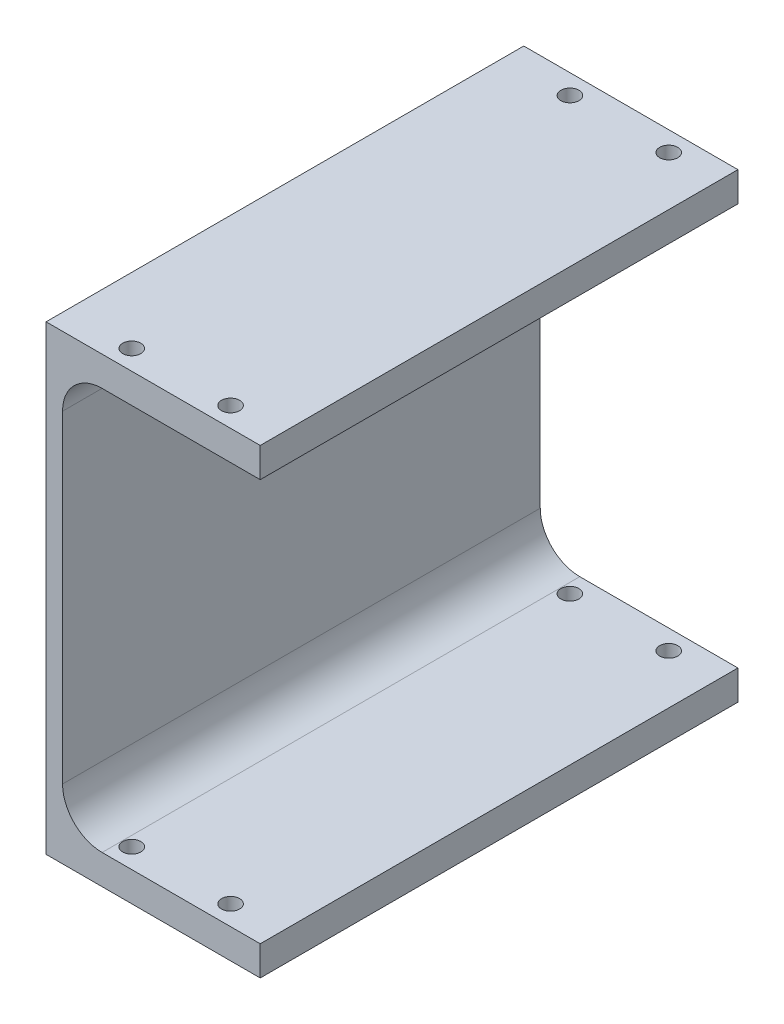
ISO-10303-21;
HEADER;
FILE_DESCRIPTION(('STEP AP214'),'2;1');
FILE_NAME('part.step','',(''),(''),'','','');
FILE_SCHEMA(('AUTOMOTIVE_DESIGN { 1 0 10303 214 1 1 1 1 }'));
ENDSEC;
DATA;
#1=APPLICATION_CONTEXT('core data for automotive mechanical design processes');
#2=APPLICATION_PROTOCOL_DEFINITION('international standard','automotive_design',2000,#1);
#3=PRODUCT_CONTEXT('',#1,'mechanical');
#4=PRODUCT('Part','Part','',(#3));
#5=PRODUCT_RELATED_PRODUCT_CATEGORY('part','',(#4));
#6=PRODUCT_DEFINITION_FORMATION('','',#4);
#7=PRODUCT_DEFINITION_CONTEXT('part definition',#1,'design');
#8=PRODUCT_DEFINITION('design','',#6,#7);
#9=PRODUCT_DEFINITION_SHAPE('','',#8);
#10=(LENGTH_UNIT() NAMED_UNIT(*) SI_UNIT(.MILLI.,.METRE.));
#11=(NAMED_UNIT(*) PLANE_ANGLE_UNIT() SI_UNIT($,.RADIAN.));
#12=(NAMED_UNIT(*) SI_UNIT($,.STERADIAN.) SOLID_ANGLE_UNIT());
#13=UNCERTAINTY_MEASURE_WITH_UNIT(LENGTH_MEASURE(1.E-05),#10,'distance_accuracy_value','');
#14=(GEOMETRIC_REPRESENTATION_CONTEXT(3) GLOBAL_UNCERTAINTY_ASSIGNED_CONTEXT((#13)) GLOBAL_UNIT_ASSIGNED_CONTEXT((#10,
#11,#12)) REPRESENTATION_CONTEXT('',''));
#15=CARTESIAN_POINT('',(0.,0.,0.));
#16=DIRECTION('',(0.,0.,1.));
#17=DIRECTION('',(1.,0.,0.));
#18=AXIS2_PLACEMENT_3D('',#15,#16,#17);
#19=CARTESIAN_POINT('',(15.0000000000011,-85.,50.0000000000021));
#20=DIRECTION('',(0.,0.,-1.00000000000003));
#21=DIRECTION('',(-1.00000000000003,0.,0.));
#22=AXIS2_PLACEMENT_3D('',#19,#20,#21);
#23=CYLINDRICAL_SURFACE('',#22,5.);
#24=CARTESIAN_POINT('',(15.0000000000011,-85.,50.0000000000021));
#25=DIRECTION('',(0.,0.,1.00000000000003));
#26=DIRECTION('',(1.00000000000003,0.,0.));
#27=AXIS2_PLACEMENT_3D('',#24,#25,#26);
#28=CIRCLE('',#27,5.);
#29=CARTESIAN_POINT('',(20.0000000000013,-85.,50.0000000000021));
#30=VERTEX_POINT('',#29);
#31=EDGE_CURVE('E11',#30,#30,#28,.T.);
#32=ORIENTED_EDGE('',*,*,#31,.F.);
#33=EDGE_LOOP('',(#32));
#34=FACE_BOUND('',#33,.T.);
#35=CARTESIAN_POINT('',(15.0000000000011,-85.,-50.0000000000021));
#36=DIRECTION('',(0.,0.,1.00000000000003));
#37=DIRECTION('',(1.00000000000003,0.,0.));
#38=AXIS2_PLACEMENT_3D('',#35,#36,#37);
#39=CIRCLE('',#38,5.);
#40=CARTESIAN_POINT('',(20.0000000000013,-85.,-50.0000000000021));
#41=VERTEX_POINT('',#40);
#42=EDGE_CURVE('E40',#41,#41,#39,.T.);
#43=ORIENTED_EDGE('',*,*,#42,.T.);
#44=EDGE_LOOP('',(#43));
#45=FACE_BOUND('',#44,.T.);
#46=ADVANCED_FACE('F34',(#34,#45),#23,.T.);
#47=CARTESIAN_POINT('',(15.0000000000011,-85.,50.0000000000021));
#48=DIRECTION('',(0.,0.,1.00000000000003));
#49=DIRECTION('',(1.00000000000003,0.,0.));
#50=AXIS2_PLACEMENT_3D('',#47,#48,#49);
#51=PLANE('',#50);
#52=ORIENTED_EDGE('',*,*,#31,.T.);
#53=EDGE_LOOP('',(#52));
#54=FACE_BOUND('',#53,.T.);
#55=ADVANCED_FACE('F49',(#54),#51,.T.);
#56=CARTESIAN_POINT('',(15.0000000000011,-85.,-50.0000000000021));
#57=DIRECTION('',(0.,0.,1.00000000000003));
#58=DIRECTION('',(1.00000000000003,0.,0.));
#59=AXIS2_PLACEMENT_3D('',#56,#57,#58);
#60=PLANE('',#59);
#61=ORIENTED_EDGE('',*,*,#42,.F.);
#62=EDGE_LOOP('',(#61));
#63=FACE_BOUND('',#62,.T.);
#64=ADVANCED_FACE('F47',(#63),#60,.F.);
#65=CLOSED_SHELL('',(#46,#55,#64));
#66=MANIFOLD_SOLID_BREP('B2',#65);
#67=CARTESIAN_POINT('',(65.0000000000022,69.9999999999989,72.5000000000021));
#68=DIRECTION('',(-1.00000000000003,0.,0.));
#69=DIRECTION('',(0.,-1.,0.));
#70=AXIS2_PLACEMENT_3D('',#67,#68,#69);
#71=PLANE('',#70);
#72=DIRECTION('',(0.,1.,0.));
#73=VECTOR('',#72,1.);
#74=CARTESIAN_POINT('',(65.0000000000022,69.9999999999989,-72.5000000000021));
#75=LINE('',#74,#73);
#76=CARTESIAN_POINT('',(65.0000000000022,61.,-72.5000000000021));
#77=VERTEX_POINT('',#76);
#78=CARTESIAN_POINT('',(65.0000000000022,69.9999999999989,-72.5000000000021));
#79=VERTEX_POINT('',#78);
#80=EDGE_CURVE('E144',#77,#79,#75,.T.);
#81=ORIENTED_EDGE('',*,*,#80,.T.);
#82=DIRECTION('',(0.,0.,-1.00000000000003));
#83=VECTOR('',#82,1.);
#84=CARTESIAN_POINT('',(65.0000000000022,69.9999999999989,72.5000000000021));
#85=LINE('',#84,#83);
#86=CARTESIAN_POINT('',(65.0000000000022,69.9999999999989,72.5000000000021));
#87=VERTEX_POINT('',#86);
#88=EDGE_CURVE('E152',#87,#79,#85,.T.);
#89=ORIENTED_EDGE('',*,*,#88,.F.);
#90=DIRECTION('',(0.,1.,0.));
#91=VECTOR('',#90,1.);
#92=CARTESIAN_POINT('',(65.0000000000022,69.9999999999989,72.5000000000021));
#93=LINE('',#92,#91);
#94=CARTESIAN_POINT('',(65.0000000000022,61.,72.5000000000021));
#95=VERTEX_POINT('',#94);
#96=EDGE_CURVE('E184',#95,#87,#93,.T.);
#97=ORIENTED_EDGE('',*,*,#96,.F.);
#98=DIRECTION('',(0.,0.,-1.00000000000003));
#99=VECTOR('',#98,1.);
#100=CARTESIAN_POINT('',(65.0000000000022,61.,72.5000000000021));
#101=LINE('',#100,#99);
#102=EDGE_CURVE('E163',#95,#77,#101,.T.);
#103=ORIENTED_EDGE('',*,*,#102,.T.);
#104=EDGE_LOOP('',(#81,#89,#97,#103));
#105=FACE_BOUND('',#104,.T.);
#106=ADVANCED_FACE('F62',(#105),#71,.F.);
#107=CARTESIAN_POINT('',(65.0000000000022,69.9999999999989,72.5000000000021));
#108=DIRECTION('',(0.,-1.,0.));
#109=DIRECTION('',(0.,0.,-1.00000000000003));
#110=AXIS2_PLACEMENT_3D('',#107,#108,#109);
#111=PLANE('',#110);
#112=CARTESIAN_POINT('',(20.0000000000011,70.,66.5000000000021));
#113=DIRECTION('',(0.,1.,0.));
#114=DIRECTION('',(0.,0.,1.00000000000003));
#115=AXIS2_PLACEMENT_3D('',#112,#113,#114);
#116=CIRCLE('',#115,2.74999999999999);
#117=CARTESIAN_POINT('',(20.0000000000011,70.,69.2500000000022));
#118=VERTEX_POINT('',#117);
#119=EDGE_CURVE('E337',#118,#118,#116,.T.);
#120=ORIENTED_EDGE('',*,*,#119,.F.);
#121=EDGE_LOOP('',(#120));
#122=FACE_BOUND('',#121,.T.);
#123=CARTESIAN_POINT('',(20.0000000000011,70.,-66.5000000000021));
#124=DIRECTION('',(0.,1.,0.));
#125=DIRECTION('',(0.,0.,1.00000000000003));
#126=AXIS2_PLACEMENT_3D('',#123,#124,#125);
#127=CIRCLE('',#126,2.74999999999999);
#128=CARTESIAN_POINT('',(20.0000000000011,70.,-63.750000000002));
#129=VERTEX_POINT('',#128);
#130=EDGE_CURVE('E234',#129,#129,#127,.T.);
#131=ORIENTED_EDGE('',*,*,#130,.F.);
#132=EDGE_LOOP('',(#131));
#133=FACE_BOUND('',#132,.T.);
#134=CARTESIAN_POINT('',(50.0000000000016,70.,-66.5000000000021));
#135=DIRECTION('',(0.,1.,0.));
#136=DIRECTION('',(0.,0.,1.00000000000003));
#137=AXIS2_PLACEMENT_3D('',#134,#135,#136);
#138=CIRCLE('',#137,2.74999999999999);
#139=CARTESIAN_POINT('',(50.0000000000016,70.,-63.750000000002));
#140=VERTEX_POINT('',#139);
#141=EDGE_CURVE('E230',#140,#140,#138,.T.);
#142=ORIENTED_EDGE('',*,*,#141,.F.);
#143=EDGE_LOOP('',(#142));
#144=FACE_BOUND('',#143,.T.);
#145=CARTESIAN_POINT('',(50.0000000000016,70.,66.5000000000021));
#146=DIRECTION('',(0.,1.,0.));
#147=DIRECTION('',(0.,0.,1.00000000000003));
#148=AXIS2_PLACEMENT_3D('',#145,#146,#147);
#149=CIRCLE('',#148,2.74999999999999);
#150=CARTESIAN_POINT('',(50.0000000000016,70.,69.2500000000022));
#151=VERTEX_POINT('',#150);
#152=EDGE_CURVE('E226',#151,#151,#149,.T.);
#153=ORIENTED_EDGE('',*,*,#152,.F.);
#154=EDGE_LOOP('',(#153));
#155=FACE_BOUND('',#154,.T.);
#156=DIRECTION('',(-1.00000000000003,0.,0.));
#157=VECTOR('',#156,1.);
#158=CARTESIAN_POINT('',(65.0000000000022,69.9999999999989,-72.5000000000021));
#159=LINE('',#158,#157);
#160=CARTESIAN_POINT('',(0.,70.,-72.5000000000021));
#161=VERTEX_POINT('',#160);
#162=EDGE_CURVE('E139',#79,#161,#159,.T.);
#163=ORIENTED_EDGE('',*,*,#162,.T.);
#164=DIRECTION('',(0.,0.,-1.00000000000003));
#165=VECTOR('',#164,1.);
#166=CARTESIAN_POINT('',(0.,70.,72.5000000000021));
#167=LINE('',#166,#165);
#168=CARTESIAN_POINT('',(0.,70.,72.5000000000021));
#169=VERTEX_POINT('',#168);
#170=EDGE_CURVE('E159',#169,#161,#167,.T.);
#171=ORIENTED_EDGE('',*,*,#170,.F.);
#172=DIRECTION('',(-1.00000000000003,0.,0.));
#173=VECTOR('',#172,1.);
#174=CARTESIAN_POINT('',(65.0000000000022,69.9999999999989,72.5000000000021));
#175=LINE('',#174,#173);
#176=EDGE_CURVE('E154',#87,#169,#175,.T.);
#177=ORIENTED_EDGE('',*,*,#176,.F.);
#178=ORIENTED_EDGE('',*,*,#88,.T.);
#179=EDGE_LOOP('',(#163,#171,#177,#178));
#180=FACE_BOUND('',#179,.T.);
#181=ADVANCED_FACE('F153',(#122,#133,#144,#155,#180),#111,.F.);
#182=CARTESIAN_POINT('',(0.,70.,72.5000000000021));
#183=DIRECTION('',(1.00000000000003,0.,0.));
#184=DIRECTION('',(0.,0.,-1.00000000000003));
#185=AXIS2_PLACEMENT_3D('',#182,#183,#184);
#186=PLANE('',#185);
#187=DIRECTION('',(0.,-1.,0.));
#188=VECTOR('',#187,1.);
#189=CARTESIAN_POINT('',(0.,70.,-72.5000000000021));
#190=LINE('',#189,#188);
#191=CARTESIAN_POINT('',(0.,-70.,-72.5000000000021));
#192=VERTEX_POINT('',#191);
#193=EDGE_CURVE('E146',#161,#192,#190,.T.);
#194=ORIENTED_EDGE('',*,*,#193,.T.);
#195=DIRECTION('',(0.,0.,-1.00000000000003));
#196=VECTOR('',#195,1.);
#197=CARTESIAN_POINT('',(0.,-70.,72.5000000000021));
#198=LINE('',#197,#196);
#199=CARTESIAN_POINT('',(0.,-70.,72.5000000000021));
#200=VERTEX_POINT('',#199);
#201=EDGE_CURVE('E207',#200,#192,#198,.T.);
#202=ORIENTED_EDGE('',*,*,#201,.F.);
#203=DIRECTION('',(0.,-1.,0.));
#204=VECTOR('',#203,1.);
#205=CARTESIAN_POINT('',(0.,70.,72.5000000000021));
#206=LINE('',#205,#204);
#207=EDGE_CURVE('E187',#169,#200,#206,.T.);
#208=ORIENTED_EDGE('',*,*,#207,.F.);
#209=ORIENTED_EDGE('',*,*,#170,.T.);
#210=EDGE_LOOP('',(#194,#202,#208,#209));
#211=FACE_BOUND('',#210,.T.);
#212=ADVANCED_FACE('F265',(#211),#186,.F.);
#213=CARTESIAN_POINT('',(65.0000000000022,-70.,72.5000000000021));
#214=DIRECTION('',(0.,1.,0.));
#215=DIRECTION('',(0.,0.,1.00000000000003));
#216=AXIS2_PLACEMENT_3D('',#213,#214,#215);
#217=PLANE('',#216);
#218=CARTESIAN_POINT('',(20.0000000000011,-70.,66.5000000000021));
#219=DIRECTION('',(0.,1.,0.));
#220=DIRECTION('',(0.,0.,1.00000000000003));
#221=AXIS2_PLACEMENT_3D('',#218,#219,#220);
#222=CIRCLE('',#221,2.74999999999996);
#223=CARTESIAN_POINT('',(20.0000000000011,-70.,69.2500000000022));
#224=VERTEX_POINT('',#223);
#225=EDGE_CURVE('E333',#224,#224,#222,.T.);
#226=ORIENTED_EDGE('',*,*,#225,.T.);
#227=EDGE_LOOP('',(#226));
#228=FACE_BOUND('',#227,.T.);
#229=CARTESIAN_POINT('',(20.0000000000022,-70.,-66.5000000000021));
#230=DIRECTION('',(0.,1.,0.));
#231=DIRECTION('',(0.,0.,1.00000000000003));
#232=AXIS2_PLACEMENT_3D('',#229,#230,#231);
#233=CIRCLE('',#232,2.74999999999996);
#234=CARTESIAN_POINT('',(20.0000000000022,-70.,-63.7500000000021));
#235=VERTEX_POINT('',#234);
#236=EDGE_CURVE('E241',#235,#235,#233,.T.);
#237=ORIENTED_EDGE('',*,*,#236,.T.);
#238=EDGE_LOOP('',(#237));
#239=FACE_BOUND('',#238,.T.);
#240=CARTESIAN_POINT('',(50.0000000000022,-70.,-66.5000000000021));
#241=DIRECTION('',(0.,1.,0.));
#242=DIRECTION('',(0.,0.,1.00000000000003));
#243=AXIS2_PLACEMENT_3D('',#240,#241,#242);
#244=CIRCLE('',#243,2.74999999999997);
#245=CARTESIAN_POINT('',(50.0000000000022,-70.,-63.7500000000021));
#246=VERTEX_POINT('',#245);
#247=EDGE_CURVE('E238',#246,#246,#244,.T.);
#248=ORIENTED_EDGE('',*,*,#247,.T.);
#249=EDGE_LOOP('',(#248));
#250=FACE_BOUND('',#249,.T.);
#251=CARTESIAN_POINT('',(50.0000000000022,-70.,66.5000000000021));
#252=DIRECTION('',(0.,1.,0.));
#253=DIRECTION('',(0.,0.,1.00000000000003));
#254=AXIS2_PLACEMENT_3D('',#251,#252,#253);
#255=CIRCLE('',#254,2.74999999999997);
#256=CARTESIAN_POINT('',(50.0000000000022,-70.,69.2500000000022));
#257=VERTEX_POINT('',#256);
#258=EDGE_CURVE('E256',#257,#257,#255,.T.);
#259=ORIENTED_EDGE('',*,*,#258,.T.);
#260=EDGE_LOOP('',(#259));
#261=FACE_BOUND('',#260,.T.);
#262=DIRECTION('',(1.00000000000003,0.,0.));
#263=VECTOR('',#262,1.);
#264=CARTESIAN_POINT('',(65.0000000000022,-70.,-72.5000000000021));
#265=LINE('',#264,#263);
#266=CARTESIAN_POINT('',(65.0000000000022,-70.,-72.5000000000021));
#267=VERTEX_POINT('',#266);
#268=EDGE_CURVE('E172',#192,#267,#265,.T.);
#269=ORIENTED_EDGE('',*,*,#268,.T.);
#270=DIRECTION('',(0.,0.,-1.00000000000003));
#271=VECTOR('',#270,1.);
#272=CARTESIAN_POINT('',(65.0000000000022,-70.,72.5000000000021));
#273=LINE('',#272,#271);
#274=CARTESIAN_POINT('',(65.0000000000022,-70.,72.5000000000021));
#275=VERTEX_POINT('',#274);
#276=EDGE_CURVE('E204',#275,#267,#273,.T.);
#277=ORIENTED_EDGE('',*,*,#276,.F.);
#278=DIRECTION('',(1.00000000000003,0.,0.));
#279=VECTOR('',#278,1.);
#280=CARTESIAN_POINT('',(65.0000000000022,-70.,72.5000000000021));
#281=LINE('',#280,#279);
#282=EDGE_CURVE('E189',#200,#275,#281,.T.);
#283=ORIENTED_EDGE('',*,*,#282,.F.);
#284=ORIENTED_EDGE('',*,*,#201,.T.);
#285=EDGE_LOOP('',(#269,#277,#283,#284));
#286=FACE_BOUND('',#285,.T.);
#287=ADVANCED_FACE('F271',(#228,#239,#250,#261,#286),#217,.F.);
#288=CARTESIAN_POINT('',(65.0000000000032,-61.,72.5000000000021));
#289=DIRECTION('',(-1.00000000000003,0.,0.));
#290=DIRECTION('',(0.,-1.,0.));
#291=AXIS2_PLACEMENT_3D('',#288,#289,#290);
#292=PLANE('',#291);
#293=DIRECTION('',(0.,1.,0.));
#294=VECTOR('',#293,1.);
#295=CARTESIAN_POINT('',(65.0000000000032,-61.,-72.5000000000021));
#296=LINE('',#295,#294);
#297=CARTESIAN_POINT('',(65.0000000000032,-61.,-72.5000000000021));
#298=VERTEX_POINT('',#297);
#299=EDGE_CURVE('E174',#267,#298,#296,.T.);
#300=ORIENTED_EDGE('',*,*,#299,.T.);
#301=DIRECTION('',(0.,0.,-1.00000000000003));
#302=VECTOR('',#301,1.);
#303=CARTESIAN_POINT('',(65.0000000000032,-61.,72.5000000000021));
#304=LINE('',#303,#302);
#305=CARTESIAN_POINT('',(65.0000000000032,-61.,72.5000000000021));
#306=VERTEX_POINT('',#305);
#307=EDGE_CURVE('E201',#306,#298,#304,.T.);
#308=ORIENTED_EDGE('',*,*,#307,.F.);
#309=DIRECTION('',(0.,1.,0.));
#310=VECTOR('',#309,1.);
#311=CARTESIAN_POINT('',(65.0000000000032,-61.,72.5000000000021));
#312=LINE('',#311,#310);
#313=EDGE_CURVE('E191',#275,#306,#312,.T.);
#314=ORIENTED_EDGE('',*,*,#313,.F.);
#315=ORIENTED_EDGE('',*,*,#276,.T.);
#316=EDGE_LOOP('',(#300,#308,#314,#315));
#317=FACE_BOUND('',#316,.T.);
#318=ADVANCED_FACE('F279',(#317),#292,.F.);
#319=CARTESIAN_POINT('',(65.0000000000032,-61.,72.5000000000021));
#320=DIRECTION('',(0.,-1.,0.));
#321=DIRECTION('',(1.00000000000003,0.,0.));
#322=AXIS2_PLACEMENT_3D('',#319,#320,#321);
#323=PLANE('',#322);
#324=CARTESIAN_POINT('',(20.,-61.,66.5000000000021));
#325=DIRECTION('',(0.,-1.,0.));
#326=DIRECTION('',(1.00000000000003,0.,0.));
#327=AXIS2_PLACEMENT_3D('',#324,#325,#326);
#328=CIRCLE('',#327,2.74999999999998);
#329=CARTESIAN_POINT('',(22.7500000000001,-61.,66.5000000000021));
#330=VERTEX_POINT('',#329);
#331=EDGE_CURVE('E246',#330,#330,#328,.T.);
#332=ORIENTED_EDGE('',*,*,#331,.T.);
#333=EDGE_LOOP('',(#332));
#334=FACE_BOUND('',#333,.T.);
#335=CARTESIAN_POINT('',(20.0000000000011,-61.,-66.5000000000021));
#336=DIRECTION('',(0.,-1.,0.));
#337=DIRECTION('',(1.00000000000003,0.,0.));
#338=AXIS2_PLACEMENT_3D('',#335,#336,#337);
#339=CIRCLE('',#338,2.74999999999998);
#340=CARTESIAN_POINT('',(22.7500000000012,-61.,-66.5000000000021));
#341=VERTEX_POINT('',#340);
#342=EDGE_CURVE('E233',#341,#341,#339,.T.);
#343=ORIENTED_EDGE('',*,*,#342,.T.);
#344=EDGE_LOOP('',(#343));
#345=FACE_BOUND('',#344,.T.);
#346=CARTESIAN_POINT('',(50.0000000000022,-61.,-66.5000000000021));
#347=DIRECTION('',(0.,-1.,0.));
#348=DIRECTION('',(1.00000000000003,0.,0.));
#349=AXIS2_PLACEMENT_3D('',#346,#347,#348);
#350=CIRCLE('',#349,2.74999999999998);
#351=CARTESIAN_POINT('',(52.7500000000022,-61.,-66.5000000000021));
#352=VERTEX_POINT('',#351);
#353=EDGE_CURVE('E229',#352,#352,#350,.T.);
#354=ORIENTED_EDGE('',*,*,#353,.T.);
#355=EDGE_LOOP('',(#354));
#356=FACE_BOUND('',#355,.T.);
#357=CARTESIAN_POINT('',(50.0000000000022,-61.,66.5000000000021));
#358=DIRECTION('',(0.,-1.,0.));
#359=DIRECTION('',(1.00000000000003,0.,0.));
#360=AXIS2_PLACEMENT_3D('',#357,#358,#359);
#361=CIRCLE('',#360,2.74999999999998);
#362=CARTESIAN_POINT('',(52.7500000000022,-61.,66.5000000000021));
#363=VERTEX_POINT('',#362);
#364=EDGE_CURVE('E164',#363,#363,#361,.T.);
#365=ORIENTED_EDGE('',*,*,#364,.T.);
#366=EDGE_LOOP('',(#365));
#367=FACE_BOUND('',#366,.T.);
#368=DIRECTION('',(-1.00000000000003,0.,0.));
#369=VECTOR('',#368,1.);
#370=CARTESIAN_POINT('',(65.0000000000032,-61.,-72.5000000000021));
#371=LINE('',#370,#369);
#372=CARTESIAN_POINT('',(17.0000000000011,-61.,-72.5000000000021));
#373=VERTEX_POINT('',#372);
#374=EDGE_CURVE('E176',#298,#373,#371,.T.);
#375=ORIENTED_EDGE('',*,*,#374,.T.);
#376=DIRECTION('',(0.,0.,-1.00000000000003));
#377=VECTOR('',#376,1.);
#378=CARTESIAN_POINT('',(17.,-61.,72.5000000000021));
#379=LINE('',#378,#377);
#380=CARTESIAN_POINT('',(17.,-61.,72.5000000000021));
#381=VERTEX_POINT('',#380);
#382=EDGE_CURVE('E215',#373,#381,#379,.F.);
#383=ORIENTED_EDGE('',*,*,#382,.T.);
#384=DIRECTION('',(-1.00000000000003,0.,0.));
#385=VECTOR('',#384,1.);
#386=CARTESIAN_POINT('',(65.0000000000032,-61.,72.5000000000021));
#387=LINE('',#386,#385);
#388=EDGE_CURVE('E193',#306,#381,#387,.T.);
#389=ORIENTED_EDGE('',*,*,#388,.F.);
#390=ORIENTED_EDGE('',*,*,#307,.T.);
#391=EDGE_LOOP('',(#375,#383,#389,#390));
#392=FACE_BOUND('',#391,.T.);
#393=ADVANCED_FACE('F283',(#334,#345,#356,#367,#392),#323,.F.);
#394=CARTESIAN_POINT('',(4.99999999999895,61.,72.5000000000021));
#395=DIRECTION('',(-1.00000000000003,0.,0.));
#396=DIRECTION('',(0.,0.,1.00000000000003));
#397=AXIS2_PLACEMENT_3D('',#394,#395,#396);
#398=PLANE('',#397);
#399=DIRECTION('',(0.,1.,0.));
#400=VECTOR('',#399,1.);
#401=CARTESIAN_POINT('',(4.99999999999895,61.,72.5000000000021));
#402=LINE('',#401,#400);
#403=CARTESIAN_POINT('',(5.00000000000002,-49.,72.5000000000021));
#404=VERTEX_POINT('',#403);
#405=CARTESIAN_POINT('',(5.00000000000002,49.,72.5000000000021));
#406=VERTEX_POINT('',#405);
#407=EDGE_CURVE('E196',#404,#406,#402,.T.);
#408=ORIENTED_EDGE('',*,*,#407,.F.);
#409=DIRECTION('',(0.,0.,-1.00000000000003));
#410=VECTOR('',#409,1.);
#411=CARTESIAN_POINT('',(5.00000000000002,-49.,-72.5000000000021));
#412=LINE('',#411,#410);
#413=CARTESIAN_POINT('',(5.00000000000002,-49.,-72.5000000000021));
#414=VERTEX_POINT('',#413);
#415=EDGE_CURVE('E212',#404,#414,#412,.T.);
#416=ORIENTED_EDGE('',*,*,#415,.T.);
#417=DIRECTION('',(0.,1.,0.));
#418=VECTOR('',#417,1.);
#419=CARTESIAN_POINT('',(5.00000000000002,61.,-72.5000000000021));
#420=LINE('',#419,#418);
#421=CARTESIAN_POINT('',(5.00000000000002,49.,-72.5000000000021));
#422=VERTEX_POINT('',#421);
#423=EDGE_CURVE('E179',#414,#422,#420,.T.);
#424=ORIENTED_EDGE('',*,*,#423,.T.);
#425=DIRECTION('',(0.,0.,-1.00000000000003));
#426=VECTOR('',#425,1.);
#427=CARTESIAN_POINT('',(5.00000000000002,49.,72.5000000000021));
#428=LINE('',#427,#426);
#429=EDGE_CURVE('E158',#422,#406,#428,.F.);
#430=ORIENTED_EDGE('',*,*,#429,.T.);
#431=EDGE_LOOP('',(#408,#416,#424,#430));
#432=FACE_BOUND('',#431,.T.);
#433=ADVANCED_FACE('F287',(#432),#398,.F.);
#434=CARTESIAN_POINT('',(65.0000000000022,61.,72.5000000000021));
#435=DIRECTION('',(0.,1.,0.));
#436=DIRECTION('',(-1.00000000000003,0.,0.));
#437=AXIS2_PLACEMENT_3D('',#434,#435,#436);
#438=PLANE('',#437);
#439=CARTESIAN_POINT('',(20.,60.9999999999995,66.5000000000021));
#440=DIRECTION('',(0.,1.,0.));
#441=DIRECTION('',(-1.00000000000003,0.,0.));
#442=AXIS2_PLACEMENT_3D('',#439,#440,#441);
#443=CIRCLE('',#442,2.74999999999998);
#444=CARTESIAN_POINT('',(17.25,60.9999999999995,66.5000000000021));
#445=VERTEX_POINT('',#444);
#446=EDGE_CURVE('E65',#445,#445,#443,.T.);
#447=ORIENTED_EDGE('',*,*,#446,.T.);
#448=EDGE_LOOP('',(#447));
#449=FACE_BOUND('',#448,.T.);
#450=CARTESIAN_POINT('',(20.0000000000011,60.9999999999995,-66.5000000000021));
#451=DIRECTION('',(0.,1.,0.));
#452=DIRECTION('',(-1.00000000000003,0.,0.));
#453=AXIS2_PLACEMENT_3D('',#450,#451,#452);
#454=CIRCLE('',#453,2.74999999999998);
#455=CARTESIAN_POINT('',(17.250000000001,60.9999999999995,-66.5000000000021));
#456=VERTEX_POINT('',#455);
#457=EDGE_CURVE('E231',#456,#456,#454,.T.);
#458=ORIENTED_EDGE('',*,*,#457,.T.);
#459=EDGE_LOOP('',(#458));
#460=FACE_BOUND('',#459,.T.);
#461=CARTESIAN_POINT('',(50.0000000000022,61.,-66.5000000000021));
#462=DIRECTION('',(0.,1.,0.));
#463=DIRECTION('',(-1.00000000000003,0.,0.));
#464=AXIS2_PLACEMENT_3D('',#461,#462,#463);
#465=CIRCLE('',#464,2.74999999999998);
#466=CARTESIAN_POINT('',(47.2500000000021,61.,-66.5000000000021));
#467=VERTEX_POINT('',#466);
#468=EDGE_CURVE('E227',#467,#467,#465,.T.);
#469=ORIENTED_EDGE('',*,*,#468,.T.);
#470=EDGE_LOOP('',(#469));
#471=FACE_BOUND('',#470,.T.);
#472=CARTESIAN_POINT('',(50.0000000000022,61.,66.5000000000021));
#473=DIRECTION('',(0.,1.,0.));
#474=DIRECTION('',(-1.00000000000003,0.,0.));
#475=AXIS2_PLACEMENT_3D('',#472,#473,#474);
#476=CIRCLE('',#475,2.74999999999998);
#477=CARTESIAN_POINT('',(47.2500000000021,61.,66.5000000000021));
#478=VERTEX_POINT('',#477);
#479=EDGE_CURVE('E167',#478,#478,#476,.T.);
#480=ORIENTED_EDGE('',*,*,#479,.T.);
#481=EDGE_LOOP('',(#480));
#482=FACE_BOUND('',#481,.T.);
#483=DIRECTION('',(1.00000000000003,0.,0.));
#484=VECTOR('',#483,1.);
#485=CARTESIAN_POINT('',(65.0000000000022,61.,72.5000000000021));
#486=LINE('',#485,#484);
#487=CARTESIAN_POINT('',(17.,60.9999999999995,72.5000000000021));
#488=VERTEX_POINT('',#487);
#489=EDGE_CURVE('E198',#488,#95,#486,.T.);
#490=ORIENTED_EDGE('',*,*,#489,.F.);
#491=DIRECTION('',(0.,0.,-1.00000000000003));
#492=VECTOR('',#491,1.);
#493=CARTESIAN_POINT('',(17.0000000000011,60.9999999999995,-72.5000000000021));
#494=LINE('',#493,#492);
#495=CARTESIAN_POINT('',(17.0000000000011,60.9999999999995,-72.5000000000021));
#496=VERTEX_POINT('',#495);
#497=EDGE_CURVE('E217',#488,#496,#494,.T.);
#498=ORIENTED_EDGE('',*,*,#497,.T.);
#499=DIRECTION('',(1.00000000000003,0.,0.));
#500=VECTOR('',#499,1.);
#501=CARTESIAN_POINT('',(65.0000000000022,61.,-72.5000000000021));
#502=LINE('',#501,#500);
#503=EDGE_CURVE('E182',#496,#77,#502,.T.);
#504=ORIENTED_EDGE('',*,*,#503,.T.);
#505=ORIENTED_EDGE('',*,*,#102,.F.);
#506=EDGE_LOOP('',(#490,#498,#504,#505));
#507=FACE_BOUND('',#506,.T.);
#508=ADVANCED_FACE('F291',(#449,#460,#471,#482,#507),#438,.F.);
#509=CARTESIAN_POINT('',(65.0000000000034,-61.,72.5000000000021));
#510=DIRECTION('',(0.,0.,-1.00000000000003));
#511=DIRECTION('',(-1.00000000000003,0.,0.));
#512=AXIS2_PLACEMENT_3D('',#509,#510,#511);
#513=PLANE('',#512);
#514=ORIENTED_EDGE('',*,*,#96,.T.);
#515=ORIENTED_EDGE('',*,*,#176,.T.);
#516=ORIENTED_EDGE('',*,*,#207,.T.);
#517=ORIENTED_EDGE('',*,*,#282,.T.);
#518=ORIENTED_EDGE('',*,*,#313,.T.);
#519=ORIENTED_EDGE('',*,*,#388,.T.);
#520=CARTESIAN_POINT('',(17.0000000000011,-49.,72.5000000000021));
#521=DIRECTION('',(0.,0.,-1.00000000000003));
#522=DIRECTION('',(-1.00000000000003,0.,0.));
#523=AXIS2_PLACEMENT_3D('',#520,#521,#522);
#524=CIRCLE('',#523,12.);
#525=EDGE_CURVE('E221',#381,#404,#524,.T.);
#526=ORIENTED_EDGE('',*,*,#525,.T.);
#527=ORIENTED_EDGE('',*,*,#407,.T.);
#528=CARTESIAN_POINT('',(17.0000000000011,48.9999999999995,72.5000000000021));
#529=DIRECTION('',(0.,0.,-1.00000000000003));
#530=DIRECTION('',(-1.00000000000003,0.,0.));
#531=AXIS2_PLACEMENT_3D('',#528,#529,#530);
#532=CIRCLE('',#531,12.);
#533=EDGE_CURVE('E32',#406,#488,#532,.T.);
#534=ORIENTED_EDGE('',*,*,#533,.T.);
#535=ORIENTED_EDGE('',*,*,#489,.T.);
#536=EDGE_LOOP('',(#514,#515,#516,#517,#518,#519,#526,#527,#534,#535));
#537=FACE_BOUND('',#536,.T.);
#538=ADVANCED_FACE('F295',(#537),#513,.F.);
#539=CARTESIAN_POINT('',(65.0000000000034,-61.,-72.5000000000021));
#540=DIRECTION('',(0.,0.,-1.00000000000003));
#541=DIRECTION('',(-1.00000000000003,0.,0.));
#542=AXIS2_PLACEMENT_3D('',#539,#540,#541);
#543=PLANE('',#542);
#544=ORIENTED_EDGE('',*,*,#80,.F.);
#545=ORIENTED_EDGE('',*,*,#503,.F.);
#546=CARTESIAN_POINT('',(17.0000000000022,48.9999999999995,-72.5000000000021));
#547=DIRECTION('',(0.,0.,-1.00000000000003));
#548=DIRECTION('',(-1.00000000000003,0.,0.));
#549=AXIS2_PLACEMENT_3D('',#546,#547,#548);
#550=CIRCLE('',#549,12.);
#551=EDGE_CURVE('E70',#496,#422,#550,.F.);
#552=ORIENTED_EDGE('',*,*,#551,.T.);
#553=ORIENTED_EDGE('',*,*,#423,.F.);
#554=CARTESIAN_POINT('',(17.0000000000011,-49.,-72.5000000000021));
#555=DIRECTION('',(0.,0.,-1.00000000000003));
#556=DIRECTION('',(-1.00000000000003,0.,0.));
#557=AXIS2_PLACEMENT_3D('',#554,#555,#556);
#558=CIRCLE('',#557,12.);
#559=EDGE_CURVE('E219',#414,#373,#558,.F.);
#560=ORIENTED_EDGE('',*,*,#559,.T.);
#561=ORIENTED_EDGE('',*,*,#374,.F.);
#562=ORIENTED_EDGE('',*,*,#299,.F.);
#563=ORIENTED_EDGE('',*,*,#268,.F.);
#564=ORIENTED_EDGE('',*,*,#193,.F.);
#565=ORIENTED_EDGE('',*,*,#162,.F.);
#566=EDGE_LOOP('',(#544,#545,#552,#553,#560,#561,#562,#563,#564,#565));
#567=FACE_BOUND('',#566,.T.);
#568=ADVANCED_FACE('F141',(#567),#543,.T.);
#569=CARTESIAN_POINT('',(17.0000000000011,-49.,72.5000000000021));
#570=DIRECTION('',(0.,0.,1.00000000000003));
#571=DIRECTION('',(1.00000000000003,0.,0.));
#572=AXIS2_PLACEMENT_3D('',#569,#570,#571);
#573=CYLINDRICAL_SURFACE('',#572,12.);
#574=ORIENTED_EDGE('',*,*,#525,.F.);
#575=ORIENTED_EDGE('',*,*,#382,.F.);
#576=ORIENTED_EDGE('',*,*,#559,.F.);
#577=ORIENTED_EDGE('',*,*,#415,.F.);
#578=EDGE_LOOP('',(#574,#575,#576,#577));
#579=FACE_BOUND('',#578,.T.);
#580=ADVANCED_FACE('F301',(#579),#573,.F.);
#581=CARTESIAN_POINT('',(17.0000000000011,48.9999999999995,72.5000000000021));
#582=DIRECTION('',(0.,0.,1.00000000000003));
#583=DIRECTION('',(1.00000000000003,0.,0.));
#584=AXIS2_PLACEMENT_3D('',#581,#582,#583);
#585=CYLINDRICAL_SURFACE('',#584,12.);
#586=ORIENTED_EDGE('',*,*,#533,.F.);
#587=ORIENTED_EDGE('',*,*,#429,.F.);
#588=ORIENTED_EDGE('',*,*,#551,.F.);
#589=ORIENTED_EDGE('',*,*,#497,.F.);
#590=EDGE_LOOP('',(#586,#587,#588,#589));
#591=FACE_BOUND('',#590,.T.);
#592=ADVANCED_FACE('F304',(#591),#585,.F.);
#593=CARTESIAN_POINT('',(50.0000000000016,70.,66.5000000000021));
#594=DIRECTION('',(0.,1.,0.));
#595=DIRECTION('',(0.,0.,1.00000000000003));
#596=AXIS2_PLACEMENT_3D('',#593,#594,#595);
#597=CYLINDRICAL_SURFACE('',#596,2.74999999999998);
#598=ORIENTED_EDGE('',*,*,#152,.T.);
#599=EDGE_LOOP('',(#598));
#600=FACE_BOUND('',#599,.T.);
#601=ORIENTED_EDGE('',*,*,#479,.F.);
#602=EDGE_LOOP('',(#601));
#603=FACE_BOUND('',#602,.T.);
#604=ADVANCED_FACE('F261',(#600,#603),#597,.F.);
#605=ORIENTED_EDGE('',*,*,#258,.F.);
#606=EDGE_LOOP('',(#605));
#607=FACE_BOUND('',#606,.T.);
#608=ORIENTED_EDGE('',*,*,#364,.F.);
#609=EDGE_LOOP('',(#608));
#610=FACE_BOUND('',#609,.T.);
#611=ADVANCED_FACE('F308',(#607,#610),#597,.F.);
#612=CARTESIAN_POINT('',(50.0000000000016,70.,-66.5000000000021));
#613=DIRECTION('',(0.,1.,0.));
#614=DIRECTION('',(0.,0.,1.00000000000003));
#615=AXIS2_PLACEMENT_3D('',#612,#613,#614);
#616=CYLINDRICAL_SURFACE('',#615,2.74999999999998);
#617=ORIENTED_EDGE('',*,*,#141,.T.);
#618=EDGE_LOOP('',(#617));
#619=FACE_BOUND('',#618,.T.);
#620=ORIENTED_EDGE('',*,*,#468,.F.);
#621=EDGE_LOOP('',(#620));
#622=FACE_BOUND('',#621,.T.);
#623=ADVANCED_FACE('F311',(#619,#622),#616,.F.);
#624=ORIENTED_EDGE('',*,*,#247,.F.);
#625=EDGE_LOOP('',(#624));
#626=FACE_BOUND('',#625,.T.);
#627=ORIENTED_EDGE('',*,*,#353,.F.);
#628=EDGE_LOOP('',(#627));
#629=FACE_BOUND('',#628,.T.);
#630=ADVANCED_FACE('F313',(#626,#629),#616,.F.);
#631=CARTESIAN_POINT('',(20.0000000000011,70.,-66.5000000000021));
#632=DIRECTION('',(0.,1.,0.));
#633=DIRECTION('',(0.,0.,1.00000000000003));
#634=AXIS2_PLACEMENT_3D('',#631,#632,#633);
#635=CYLINDRICAL_SURFACE('',#634,2.74999999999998);
#636=ORIENTED_EDGE('',*,*,#130,.T.);
#637=EDGE_LOOP('',(#636));
#638=FACE_BOUND('',#637,.T.);
#639=ORIENTED_EDGE('',*,*,#457,.F.);
#640=EDGE_LOOP('',(#639));
#641=FACE_BOUND('',#640,.T.);
#642=ADVANCED_FACE('F316',(#638,#641),#635,.F.);
#643=ORIENTED_EDGE('',*,*,#236,.F.);
#644=EDGE_LOOP('',(#643));
#645=FACE_BOUND('',#644,.T.);
#646=ORIENTED_EDGE('',*,*,#342,.F.);
#647=EDGE_LOOP('',(#646));
#648=FACE_BOUND('',#647,.T.);
#649=ADVANCED_FACE('F318',(#645,#648),#635,.F.);
#650=CARTESIAN_POINT('',(20.0000000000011,70.,66.5000000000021));
#651=DIRECTION('',(0.,1.,0.));
#652=DIRECTION('',(0.,0.,1.00000000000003));
#653=AXIS2_PLACEMENT_3D('',#650,#651,#652);
#654=CYLINDRICAL_SURFACE('',#653,2.74999999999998);
#655=ORIENTED_EDGE('',*,*,#119,.T.);
#656=EDGE_LOOP('',(#655));
#657=FACE_BOUND('',#656,.T.);
#658=ORIENTED_EDGE('',*,*,#446,.F.);
#659=EDGE_LOOP('',(#658));
#660=FACE_BOUND('',#659,.T.);
#661=ADVANCED_FACE('F321',(#657,#660),#654,.F.);
#662=ORIENTED_EDGE('',*,*,#225,.F.);
#663=EDGE_LOOP('',(#662));
#664=FACE_BOUND('',#663,.T.);
#665=ORIENTED_EDGE('',*,*,#331,.F.);
#666=EDGE_LOOP('',(#665));
#667=FACE_BOUND('',#666,.T.);
#668=ADVANCED_FACE('F323',(#664,#667),#654,.F.);
#669=CLOSED_SHELL('',(#106,#181,#212,#287,#318,#393,#433,#508,#538,#568,#580,#592,#604,#611,
#623,#630,#642,#649,#661,#668));
#670=MANIFOLD_SOLID_BREP('B6',#669);
#671=ADVANCED_BREP_SHAPE_REPRESENTATION('',(#18,#66,#670),#14);
#672=SHAPE_DEFINITION_REPRESENTATION(#9,#671);
ENDSEC;
END-ISO-10303-21;
